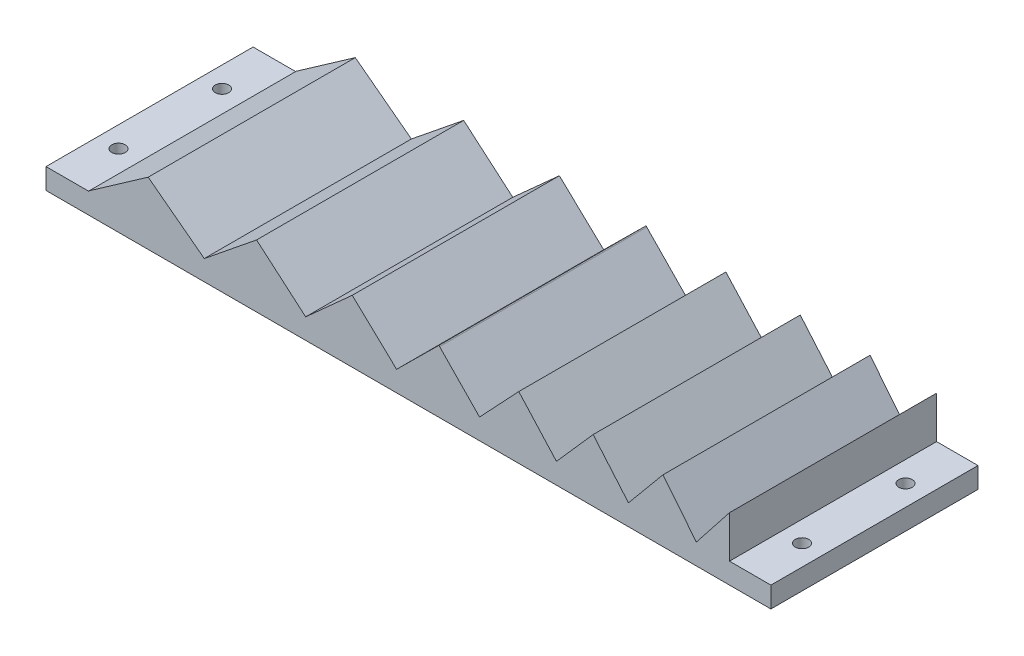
from build123d import *

# Parameters (mm, degrees)
BOSS_EXTRUDE1_DEPTH     = 100
CUT_EXTRUDE1_DEPTH      = 347.144695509
CUT_EXTRUDE1_DEPTH_BACK = 347.144695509
SKETCH2_R               = 3.25


with BuildPart() as part:
    # Model → Boss-Extrude1 (new body)
    with BuildSketch(Plane.XY):
        Polygon((57.061053, 0.26584), (81.134859, 19.725193), (81.665985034, 20.154513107), (105.380729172, -0.145962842), (127.863307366, 20.110455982), (148.848939, 0.261122), (149.285305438, -0.15161674), (149.668496, 0.25351), (169.337342, 19.728266), (169.704594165, 20.091894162), (170.054408, 19.738594), (189.006151, 0.257441), (189.324464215, -0.069764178), (189.620837, 0.245219), (207.957931, 19.73377), (208.273214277, 20.068851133), (208.57258, 19.737844), (226.192571, 0.255511), (226.45736752, -0.037273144), (226.704766, 0.242967), (243.915016, 19.737844), (244.176581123, 20.034131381), (244.427211, 19.73981), (261.022812, 0.251151), (261.234330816, 0.002758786), (261.432553, 0.241466), (277.618375, 19.733091), (277.868358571, 20.034131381), (277.881950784, 20.050008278), (278.130607, 19.740846), (293.804197, 0.253367), (294.016002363, -0.009977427), (294.213976, 0.24118), (309.58024, 19.735449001), (310, 20.26797365), (310, 0), (330, 0), (330, -10), (-20, -10), (-20, 0), (0, 0), (0.820435, 0), (0.820435, 0.273631), (29.335827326, 20.239675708), (55.729301, 0.275704), (56.423576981, -0.24944499), align=None)
    extrude(amount=BOSS_EXTRUDE1_DEPTH)

    # Sketch2 → Cut-Extrude1 (cut, two sides: drawn at the far end of the back side and taken through both)
    with BuildSketch(Plane.XZ.offset(10).offset(-CUT_EXTRUDE1_DEPTH_BACK)):
        with Locations(Location((-10, 75, 0), (0, 0, 270))):
            Circle(SKETCH2_R)
        with Locations(Location((-10, 25, 0), (0, 0, 270))):
            Circle(SKETCH2_R)
        with Locations(Location((320, 25, 0), (0, 0, 270))):
            Circle(SKETCH2_R)
        with Locations(Location((320, 75, 0), (0, 0, 270))):
            Circle(SKETCH2_R)
    extrude(amount=CUT_EXTRUDE1_DEPTH + CUT_EXTRUDE1_DEPTH_BACK, mode=Mode.SUBTRACT)


solid = part.part
